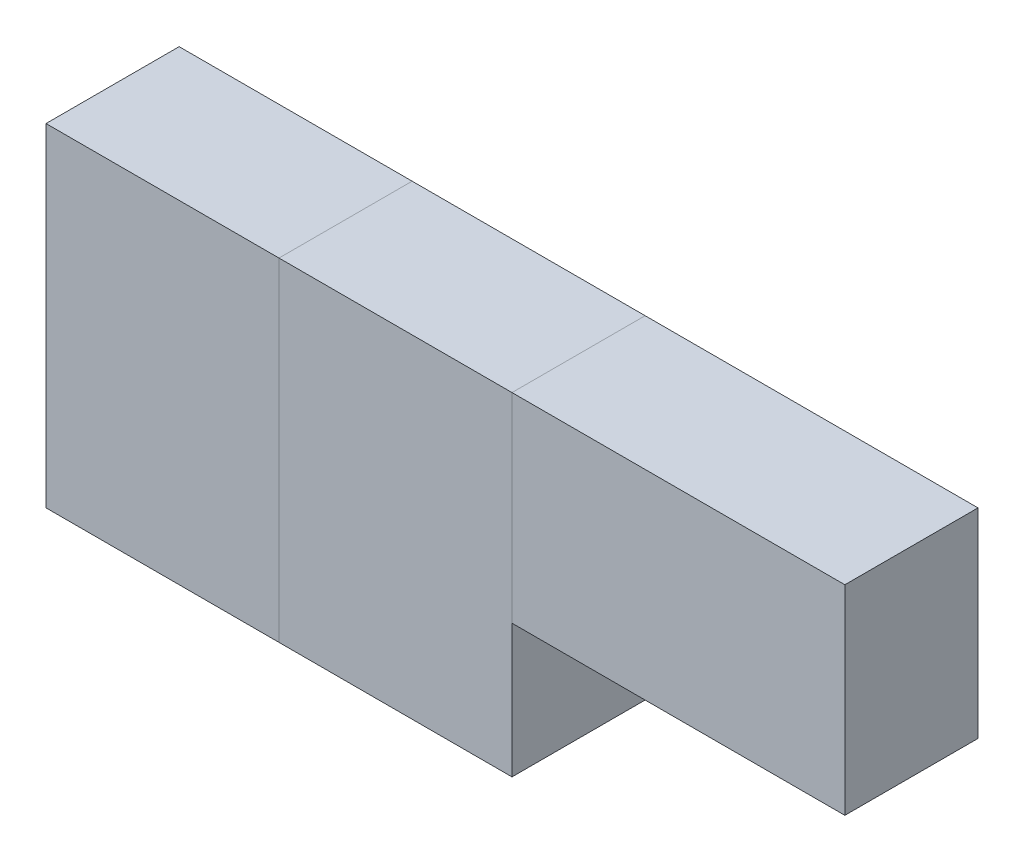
from build123d import *

# Parameters (mm, degrees)
SKETCH1_W           = 533.4
SKETCH1_H           = 762
BOSS_EXTRUDE1_DEPTH = 304.8
LPATTERN1_COUNT     = 2
LPATTERN1_PITCH     = 533.4
SKETCH2_W           = 304.8
SKETCH2_H           = 457.2
BOSS_EXTRUDE2_DEPTH = 762


with BuildPart() as part:
    # Sketch1 → Boss-Extrude1 (new body)
    with BuildSketch(Plane.XY):
        with Locations((266.7, 381)):
            Rectangle(SKETCH1_W, SKETCH1_H)
    extrude(amount=BOSS_EXTRUDE1_DEPTH)


with BuildPart() as lpattern1_1:
    # LPattern1: pattern copy
    add(part.part.moved(Location(Vector(1, 0, 0) * (1 * LPATTERN1_PITCH))))


with BuildPart() as body_3:
    # Sketch2 → Boss-Extrude2 (new body)
    with BuildSketch(Plane(origin=(1066.8, 0, 0), x_dir=(0, 0, -1), z_dir=(1, 0, 0))):
        with Locations((-152.4, 533.4)):
            Rectangle(SKETCH2_W, SKETCH2_H)
    extrude(amount=BOSS_EXTRUDE2_DEPTH)


solid = Compound([part.part, lpattern1_1.part, body_3.part])
